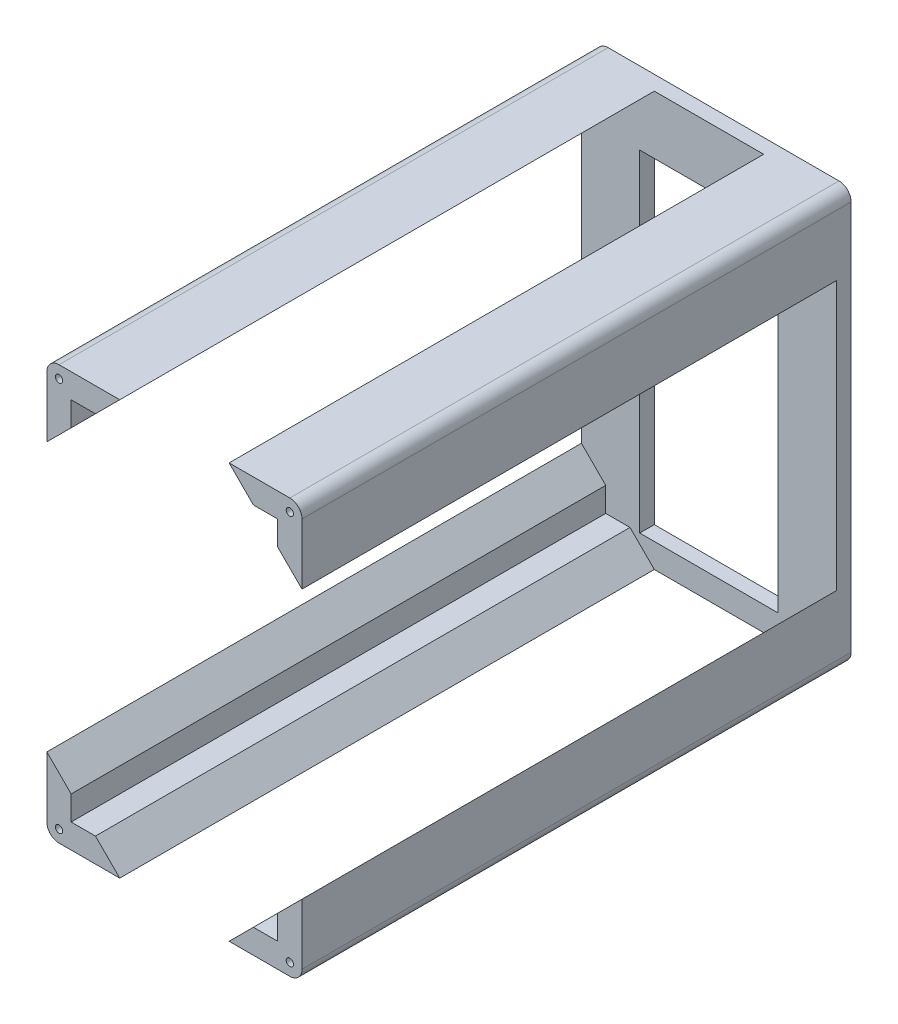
ISO-10303-21;
HEADER;
FILE_DESCRIPTION(('STEP AP214'),'2;1');
FILE_NAME('part.step','',(''),(''),'','','');
FILE_SCHEMA(('AUTOMOTIVE_DESIGN { 1 0 10303 214 1 1 1 1 }'));
ENDSEC;
DATA;
#1=APPLICATION_CONTEXT('core data for automotive mechanical design processes');
#2=APPLICATION_PROTOCOL_DEFINITION('international standard','automotive_design',2000,#1);
#3=PRODUCT_CONTEXT('',#1,'mechanical');
#4=PRODUCT('Part','Part','',(#3));
#5=PRODUCT_RELATED_PRODUCT_CATEGORY('part','',(#4));
#6=PRODUCT_DEFINITION_FORMATION('','',#4);
#7=PRODUCT_DEFINITION_CONTEXT('part definition',#1,'design');
#8=PRODUCT_DEFINITION('design','',#6,#7);
#9=PRODUCT_DEFINITION_SHAPE('','',#8);
#10=(LENGTH_UNIT() NAMED_UNIT(*) SI_UNIT(.MILLI.,.METRE.));
#11=(NAMED_UNIT(*) PLANE_ANGLE_UNIT() SI_UNIT($,.RADIAN.));
#12=(NAMED_UNIT(*) SI_UNIT($,.STERADIAN.) SOLID_ANGLE_UNIT());
#13=UNCERTAINTY_MEASURE_WITH_UNIT(LENGTH_MEASURE(1.E-05),#10,'distance_accuracy_value','');
#14=(GEOMETRIC_REPRESENTATION_CONTEXT(3) GLOBAL_UNCERTAINTY_ASSIGNED_CONTEXT((#13)) GLOBAL_UNIT_ASSIGNED_CONTEXT((#10,
#11,#12)) REPRESENTATION_CONTEXT('',''));
#15=CARTESIAN_POINT('',(0.,0.,0.));
#16=DIRECTION('',(0.,0.,1.));
#17=DIRECTION('',(1.,0.,0.));
#18=AXIS2_PLACEMENT_3D('',#15,#16,#17);
#19=CARTESIAN_POINT('',(0.,0.,226.));
#20=DIRECTION('',(0.,0.,-1.));
#21=DIRECTION('',(-1.,0.,0.));
#22=AXIS2_PLACEMENT_3D('',#19,#20,#21);
#23=PLANE('',#22);
#24=DIRECTION('',(0.,1.,0.));
#25=VECTOR('',#24,1.);
#26=CARTESIAN_POINT('',(-410.328787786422,71.,226.));
#27=LINE('',#26,#25);
#28=CARTESIAN_POINT('',(-410.328787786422,41.,226.));
#29=VERTEX_POINT('',#28);
#30=CARTESIAN_POINT('',(-410.328787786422,66.,226.));
#31=VERTEX_POINT('',#30);
#32=EDGE_CURVE('E351',#29,#31,#27,.T.);
#33=ORIENTED_EDGE('',*,*,#32,.T.);
#34=CARTESIAN_POINT('',(-415.328787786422,66.,226.));
#35=DIRECTION('',(0.,0.,-1.));
#36=DIRECTION('',(-1.,0.,0.));
#37=AXIS2_PLACEMENT_3D('',#34,#35,#36);
#38=CIRCLE('',#37,5.);
#39=CARTESIAN_POINT('',(-415.328787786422,71.,226.));
#40=VERTEX_POINT('',#39);
#41=EDGE_CURVE('E11',#31,#40,#38,.F.);
#42=ORIENTED_EDGE('',*,*,#41,.T.);
#43=DIRECTION('',(-1.,0.,0.));
#44=VECTOR('',#43,1.);
#45=CARTESIAN_POINT('',(-440.328787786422,71.,226.));
#46=LINE('',#45,#44);
#47=CARTESIAN_POINT('',(-440.328787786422,71.,226.));
#48=VERTEX_POINT('',#47);
#49=EDGE_CURVE('E366',#40,#48,#46,.T.);
#50=ORIENTED_EDGE('',*,*,#49,.T.);
#51=DIRECTION('',(0.707106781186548,-0.707106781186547,0.));
#52=VECTOR('',#51,1.);
#53=CARTESIAN_POINT('',(-410.328787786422,41.,226.));
#54=LINE('',#53,#52);
#55=CARTESIAN_POINT('',(-430.328787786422,61.,226.));
#56=VERTEX_POINT('',#55);
#57=EDGE_CURVE('E361',#48,#56,#54,.T.);
#58=ORIENTED_EDGE('',*,*,#57,.T.);
#59=DIRECTION('',(1.,0.,0.));
#60=VECTOR('',#59,1.);
#61=CARTESIAN_POINT('',(-505.328787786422,61.,226.));
#62=LINE('',#61,#60);
#63=CARTESIAN_POINT('',(-420.328787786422,61.,226.));
#64=VERTEX_POINT('',#63);
#65=EDGE_CURVE('E418',#56,#64,#62,.T.);
#66=ORIENTED_EDGE('',*,*,#65,.T.);
#67=DIRECTION('',(0.,1.,0.));
#68=VECTOR('',#67,1.);
#69=CARTESIAN_POINT('',(-420.328787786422,-89.5,226.));
#70=LINE('',#69,#68);
#71=CARTESIAN_POINT('',(-420.328787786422,51.,226.));
#72=VERTEX_POINT('',#71);
#73=EDGE_CURVE('E429',#72,#64,#70,.T.);
#74=ORIENTED_EDGE('',*,*,#73,.F.);
#75=EDGE_CURVE('E365',#72,#29,#54,.T.);
#76=ORIENTED_EDGE('',*,*,#75,.T.);
#77=EDGE_LOOP('',(#33,#42,#50,#58,#66,#74,#76));
#78=FACE_BOUND('',#77,.T.);
#79=CARTESIAN_POINT('',(-415.328787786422,66.,226.));
#80=DIRECTION('',(0.,0.,1.));
#81=DIRECTION('',(1.,0.,0.));
#82=AXIS2_PLACEMENT_3D('',#79,#80,#81);
#83=CIRCLE('',#82,1.5);
#84=CARTESIAN_POINT('',(-413.828787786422,66.,226.));
#85=VERTEX_POINT('',#84);
#86=EDGE_CURVE('E623',#85,#85,#83,.T.);
#87=ORIENTED_EDGE('',*,*,#86,.F.);
#88=EDGE_LOOP('',(#87));
#89=FACE_BOUND('',#88,.T.);
#90=ADVANCED_FACE('F36',(#78,#89),#23,.F.);
#91=CARTESIAN_POINT('',(-485.328787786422,71.,226.));
#92=DIRECTION('',(-0.707106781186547,0.707106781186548,0.));
#93=DIRECTION('',(-0.707106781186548,-0.707106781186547,0.));
#94=AXIS2_PLACEMENT_3D('',#91,#92,#93);
#95=PLANE('',#94);
#96=DIRECTION('',(0.,0.,1.));
#97=VECTOR('',#96,1.);
#98=CARTESIAN_POINT('',(-495.328787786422,61.,226.));
#99=LINE('',#98,#97);
#100=CARTESIAN_POINT('',(-495.328787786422,61.,6.00000000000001));
#101=VERTEX_POINT('',#100);
#102=CARTESIAN_POINT('',(-495.328787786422,61.,226.));
#103=VERTEX_POINT('',#102);
#104=EDGE_CURVE('E283',#101,#103,#99,.T.);
#105=ORIENTED_EDGE('',*,*,#104,.F.);
#106=DIRECTION('',(0.707106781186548,0.707106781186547,0.));
#107=VECTOR('',#106,1.);
#108=CARTESIAN_POINT('',(-485.328787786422,71.,6.));
#109=LINE('',#108,#107);
#110=CARTESIAN_POINT('',(-485.328787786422,71.,6.));
#111=VERTEX_POINT('',#110);
#112=EDGE_CURVE('E360',#101,#111,#109,.T.);
#113=ORIENTED_EDGE('',*,*,#112,.T.);
#114=DIRECTION('',(0.,0.,-1.));
#115=VECTOR('',#114,1.);
#116=CARTESIAN_POINT('',(-485.328787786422,71.,226.));
#117=LINE('',#116,#115);
#118=CARTESIAN_POINT('',(-485.328787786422,71.,226.));
#119=VERTEX_POINT('',#118);
#120=EDGE_CURVE('E393',#119,#111,#117,.T.);
#121=ORIENTED_EDGE('',*,*,#120,.F.);
#122=DIRECTION('',(0.707106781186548,0.707106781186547,0.));
#123=VECTOR('',#122,1.);
#124=CARTESIAN_POINT('',(-485.328787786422,71.,226.));
#125=LINE('',#124,#123);
#126=EDGE_CURVE('E390',#103,#119,#125,.T.);
#127=ORIENTED_EDGE('',*,*,#126,.F.);
#128=EDGE_LOOP('',(#105,#113,#121,#127));
#129=FACE_BOUND('',#128,.T.);
#130=ADVANCED_FACE('F526',(#129),#95,.F.);
#131=DIRECTION('',(0.,0.,-1.));
#132=VECTOR('',#131,1.);
#133=CARTESIAN_POINT('',(-505.328787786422,51.,226.));
#134=LINE('',#133,#132);
#135=CARTESIAN_POINT('',(-505.328787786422,51.,226.));
#136=VERTEX_POINT('',#135);
#137=CARTESIAN_POINT('',(-505.328787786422,51.,6.00000000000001));
#138=VERTEX_POINT('',#137);
#139=EDGE_CURVE('E295',#136,#138,#134,.T.);
#140=ORIENTED_EDGE('',*,*,#139,.F.);
#141=CARTESIAN_POINT('',(-515.328787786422,41.,226.));
#142=VERTEX_POINT('',#141);
#143=EDGE_CURVE('E388',#142,#136,#125,.T.);
#144=ORIENTED_EDGE('',*,*,#143,.F.);
#145=DIRECTION('',(0.,0.,-1.));
#146=VECTOR('',#145,1.);
#147=CARTESIAN_POINT('',(-515.328787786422,41.,226.));
#148=LINE('',#147,#146);
#149=CARTESIAN_POINT('',(-515.328787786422,41.,6.));
#150=VERTEX_POINT('',#149);
#151=EDGE_CURVE('E396',#142,#150,#148,.T.);
#152=ORIENTED_EDGE('',*,*,#151,.T.);
#153=EDGE_CURVE('E387',#150,#138,#109,.T.);
#154=ORIENTED_EDGE('',*,*,#153,.T.);
#155=EDGE_LOOP('',(#140,#144,#152,#154));
#156=FACE_BOUND('',#155,.T.);
#157=ADVANCED_FACE('F484',(#156),#95,.F.);
#158=CARTESIAN_POINT('',(-440.328787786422,-99.5,226.));
#159=DIRECTION('',(0.707106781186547,-0.707106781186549,0.));
#160=DIRECTION('',(0.707106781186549,0.707106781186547,0.));
#161=AXIS2_PLACEMENT_3D('',#158,#159,#160);
#162=PLANE('',#161);
#163=DIRECTION('',(-0.707106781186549,-0.707106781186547,0.));
#164=VECTOR('',#163,1.);
#165=CARTESIAN_POINT('',(-440.328787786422,-99.5,226.));
#166=LINE('',#165,#164);
#167=CARTESIAN_POINT('',(-430.328787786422,-89.5,226.));
#168=VERTEX_POINT('',#167);
#169=CARTESIAN_POINT('',(-440.328787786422,-99.5,226.));
#170=VERTEX_POINT('',#169);
#171=EDGE_CURVE('E337',#168,#170,#166,.T.);
#172=ORIENTED_EDGE('',*,*,#171,.F.);
#173=DIRECTION('',(0.,0.,-1.));
#174=VECTOR('',#173,1.);
#175=CARTESIAN_POINT('',(-430.328787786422,-89.5,226.));
#176=LINE('',#175,#174);
#177=CARTESIAN_POINT('',(-430.328787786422,-89.5,6.00000000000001));
#178=VERTEX_POINT('',#177);
#179=EDGE_CURVE('E299',#168,#178,#176,.T.);
#180=ORIENTED_EDGE('',*,*,#179,.T.);
#181=DIRECTION('',(-0.707106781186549,-0.707106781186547,0.));
#182=VECTOR('',#181,1.);
#183=CARTESIAN_POINT('',(-440.328787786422,-99.5,6.));
#184=LINE('',#183,#182);
#185=CARTESIAN_POINT('',(-440.328787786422,-99.5,6.));
#186=VERTEX_POINT('',#185);
#187=EDGE_CURVE('E251',#178,#186,#184,.T.);
#188=ORIENTED_EDGE('',*,*,#187,.T.);
#189=DIRECTION('',(0.,0.,-1.));
#190=VECTOR('',#189,1.);
#191=CARTESIAN_POINT('',(-440.328787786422,-99.5,226.));
#192=LINE('',#191,#190);
#193=EDGE_CURVE('E332',#170,#186,#192,.T.);
#194=ORIENTED_EDGE('',*,*,#193,.F.);
#195=EDGE_LOOP('',(#172,#180,#188,#194));
#196=FACE_BOUND('',#195,.T.);
#197=ADVANCED_FACE('F687',(#196),#162,.F.);
#198=CARTESIAN_POINT('',(-515.328787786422,-69.5,226.));
#199=DIRECTION('',(-0.707106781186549,-0.707106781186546,0.));
#200=DIRECTION('',(0.707106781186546,-0.707106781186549,0.));
#201=AXIS2_PLACEMENT_3D('',#198,#199,#200);
#202=PLANE('',#201);
#203=DIRECTION('',(0.,0.,1.));
#204=VECTOR('',#203,1.);
#205=CARTESIAN_POINT('',(-505.328787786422,-79.4999999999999,226.));
#206=LINE('',#205,#204);
#207=CARTESIAN_POINT('',(-505.328787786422,-79.4999999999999,6.));
#208=VERTEX_POINT('',#207);
#209=CARTESIAN_POINT('',(-505.328787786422,-79.4999999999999,226.));
#210=VERTEX_POINT('',#209);
#211=EDGE_CURVE('E292',#208,#210,#206,.T.);
#212=ORIENTED_EDGE('',*,*,#211,.F.);
#213=DIRECTION('',(-0.707106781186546,0.707106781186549,0.));
#214=VECTOR('',#213,1.);
#215=CARTESIAN_POINT('',(-515.328787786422,-69.5,6.));
#216=LINE('',#215,#214);
#217=CARTESIAN_POINT('',(-515.328787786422,-69.5,6.));
#218=VERTEX_POINT('',#217);
#219=EDGE_CURVE('E376',#208,#218,#216,.T.);
#220=ORIENTED_EDGE('',*,*,#219,.T.);
#221=DIRECTION('',(0.,0.,-1.));
#222=VECTOR('',#221,1.);
#223=CARTESIAN_POINT('',(-515.328787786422,-69.5,226.));
#224=LINE('',#223,#222);
#225=CARTESIAN_POINT('',(-515.328787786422,-69.5,226.));
#226=VERTEX_POINT('',#225);
#227=EDGE_CURVE('E369',#226,#218,#224,.T.);
#228=ORIENTED_EDGE('',*,*,#227,.F.);
#229=DIRECTION('',(-0.707106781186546,0.707106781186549,0.));
#230=VECTOR('',#229,1.);
#231=CARTESIAN_POINT('',(-515.328787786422,-69.5,226.));
#232=LINE('',#231,#230);
#233=EDGE_CURVE('E373',#210,#226,#232,.T.);
#234=ORIENTED_EDGE('',*,*,#233,.F.);
#235=EDGE_LOOP('',(#212,#220,#228,#234));
#236=FACE_BOUND('',#235,.T.);
#237=ADVANCED_FACE('F566',(#236),#202,.F.);
#238=CARTESIAN_POINT('',(0.,0.,226.));
#239=DIRECTION('',(0.,0.,1.));
#240=DIRECTION('',(1.,0.,0.));
#241=AXIS2_PLACEMENT_3D('',#238,#239,#240);
#242=PLANE('',#241);
#243=CARTESIAN_POINT('',(-510.328787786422,-94.5,226.));
#244=DIRECTION('',(0.,0.,1.));
#245=DIRECTION('',(1.,0.,0.));
#246=AXIS2_PLACEMENT_3D('',#243,#244,#245);
#247=CIRCLE('',#246,1.49999999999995);
#248=CARTESIAN_POINT('',(-508.828787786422,-94.5,226.));
#249=VERTEX_POINT('',#248);
#250=EDGE_CURVE('E496',#249,#249,#247,.T.);
#251=ORIENTED_EDGE('',*,*,#250,.F.);
#252=EDGE_LOOP('',(#251));
#253=FACE_BOUND('',#252,.T.);
#254=DIRECTION('',(0.,-1.,0.));
#255=VECTOR('',#254,1.);
#256=CARTESIAN_POINT('',(-515.328787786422,-99.5,226.));
#257=LINE('',#256,#255);
#258=CARTESIAN_POINT('',(-515.328787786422,-94.5,226.));
#259=VERTEX_POINT('',#258);
#260=EDGE_CURVE('E385',#226,#259,#257,.T.);
#261=ORIENTED_EDGE('',*,*,#260,.T.);
#262=CARTESIAN_POINT('',(-510.328787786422,-94.5,226.));
#263=DIRECTION('',(0.,0.,1.));
#264=DIRECTION('',(1.,0.,0.));
#265=AXIS2_PLACEMENT_3D('',#262,#263,#264);
#266=CIRCLE('',#265,5.);
#267=CARTESIAN_POINT('',(-510.328787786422,-99.5,226.));
#268=VERTEX_POINT('',#267);
#269=EDGE_CURVE('E445',#259,#268,#266,.T.);
#270=ORIENTED_EDGE('',*,*,#269,.T.);
#271=DIRECTION('',(1.,0.,0.));
#272=VECTOR('',#271,1.);
#273=CARTESIAN_POINT('',(-485.328787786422,-99.5,226.));
#274=LINE('',#273,#272);
#275=CARTESIAN_POINT('',(-485.328787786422,-99.5,226.));
#276=VERTEX_POINT('',#275);
#277=EDGE_CURVE('E379',#268,#276,#274,.T.);
#278=ORIENTED_EDGE('',*,*,#277,.T.);
#279=CARTESIAN_POINT('',(-495.328787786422,-89.5,226.));
#280=VERTEX_POINT('',#279);
#281=EDGE_CURVE('E380',#276,#280,#232,.T.);
#282=ORIENTED_EDGE('',*,*,#281,.T.);
#283=DIRECTION('',(1.,0.,0.));
#284=VECTOR('',#283,1.);
#285=CARTESIAN_POINT('',(-505.328787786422,-89.5,226.));
#286=LINE('',#285,#284);
#287=CARTESIAN_POINT('',(-505.328787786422,-89.5,226.));
#288=VERTEX_POINT('',#287);
#289=EDGE_CURVE('E609',#288,#280,#286,.T.);
#290=ORIENTED_EDGE('',*,*,#289,.F.);
#291=DIRECTION('',(0.,1.,0.));
#292=VECTOR('',#291,1.);
#293=CARTESIAN_POINT('',(-505.328787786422,-89.5,226.));
#294=LINE('',#293,#292);
#295=EDGE_CURVE('E288',#288,#210,#294,.T.);
#296=ORIENTED_EDGE('',*,*,#295,.T.);
#297=ORIENTED_EDGE('',*,*,#233,.T.);
#298=EDGE_LOOP('',(#261,#270,#278,#282,#290,#296,#297));
#299=FACE_BOUND('',#298,.T.);
#300=ADVANCED_FACE('F570',(#253,#299),#242,.T.);
#301=CARTESIAN_POINT('',(-410.328787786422,41.,226.));
#302=DIRECTION('',(0.707106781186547,0.707106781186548,0.));
#303=DIRECTION('',(-0.707106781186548,0.707106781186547,0.));
#304=AXIS2_PLACEMENT_3D('',#301,#302,#303);
#305=PLANE('',#304);
#306=DIRECTION('',(0.,0.,-1.));
#307=VECTOR('',#306,1.);
#308=CARTESIAN_POINT('',(-430.328787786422,61.,226.));
#309=LINE('',#308,#307);
#310=CARTESIAN_POINT('',(-430.328787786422,61.,6.00000000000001));
#311=VERTEX_POINT('',#310);
#312=EDGE_CURVE('E285',#56,#311,#309,.T.);
#313=ORIENTED_EDGE('',*,*,#312,.F.);
#314=ORIENTED_EDGE('',*,*,#57,.F.);
#315=DIRECTION('',(0.,0.,-1.));
#316=VECTOR('',#315,1.);
#317=CARTESIAN_POINT('',(-440.328787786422,71.,226.));
#318=LINE('',#317,#316);
#319=CARTESIAN_POINT('',(-440.328787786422,71.,6.));
#320=VERTEX_POINT('',#319);
#321=EDGE_CURVE('E350',#48,#320,#318,.T.);
#322=ORIENTED_EDGE('',*,*,#321,.T.);
#323=DIRECTION('',(0.707106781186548,-0.707106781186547,0.));
#324=VECTOR('',#323,1.);
#325=CARTESIAN_POINT('',(-410.328787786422,41.,6.));
#326=LINE('',#325,#324);
#327=EDGE_CURVE('E358',#320,#311,#326,.T.);
#328=ORIENTED_EDGE('',*,*,#327,.T.);
#329=EDGE_LOOP('',(#313,#314,#322,#328));
#330=FACE_BOUND('',#329,.T.);
#331=ADVANCED_FACE('F534',(#330),#305,.F.);
#332=CARTESIAN_POINT('',(0.,0.,6.));
#333=DIRECTION('',(0.,0.,-1.));
#334=DIRECTION('',(-1.,0.,0.));
#335=AXIS2_PLACEMENT_3D('',#332,#333,#334);
#336=PLANE('',#335);
#337=DIRECTION('',(1.,0.,0.));
#338=VECTOR('',#337,1.);
#339=CARTESIAN_POINT('',(-434.328787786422,-89.5,6.00000000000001));
#340=LINE('',#339,#338);
#341=CARTESIAN_POINT('',(-491.328787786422,-89.5,6.00000000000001));
#342=VERTEX_POINT('',#341);
#343=CARTESIAN_POINT('',(-434.328787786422,-89.5,6.00000000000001));
#344=VERTEX_POINT('',#343);
#345=EDGE_CURVE('E304',#342,#344,#340,.T.);
#346=ORIENTED_EDGE('',*,*,#345,.F.);
#347=DIRECTION('',(0.,-1.,0.));
#348=VECTOR('',#347,1.);
#349=CARTESIAN_POINT('',(-491.328787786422,-89.5,6.00000000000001));
#350=LINE('',#349,#348);
#351=CARTESIAN_POINT('',(-491.328787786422,47.,6.00000000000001));
#352=VERTEX_POINT('',#351);
#353=EDGE_CURVE('E308',#352,#342,#350,.T.);
#354=ORIENTED_EDGE('',*,*,#353,.F.);
#355=DIRECTION('',(-1.,0.,0.));
#356=VECTOR('',#355,1.);
#357=CARTESIAN_POINT('',(-434.328787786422,47.,6.00000000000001));
#358=LINE('',#357,#356);
#359=CARTESIAN_POINT('',(-434.328787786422,47.,6.));
#360=VERTEX_POINT('',#359);
#361=EDGE_CURVE('E309',#360,#352,#358,.T.);
#362=ORIENTED_EDGE('',*,*,#361,.F.);
#363=DIRECTION('',(0.,1.,0.));
#364=VECTOR('',#363,1.);
#365=CARTESIAN_POINT('',(-434.328787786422,-89.5,6.00000000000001));
#366=LINE('',#365,#364);
#367=EDGE_CURVE('E305',#344,#360,#366,.T.);
#368=ORIENTED_EDGE('',*,*,#367,.F.);
#369=EDGE_LOOP('',(#346,#354,#362,#368));
#370=FACE_BOUND('',#369,.T.);
#371=ORIENTED_EDGE('',*,*,#112,.F.);
#372=DIRECTION('',(1.,0.,0.));
#373=VECTOR('',#372,1.);
#374=CARTESIAN_POINT('',(-505.328787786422,61.,6.00000000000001));
#375=LINE('',#374,#373);
#376=CARTESIAN_POINT('',(-505.328787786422,61.,6.00000000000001));
#377=VERTEX_POINT('',#376);
#378=EDGE_CURVE('E489',#377,#101,#375,.T.);
#379=ORIENTED_EDGE('',*,*,#378,.F.);
#380=DIRECTION('',(0.,1.,0.));
#381=VECTOR('',#380,1.);
#382=CARTESIAN_POINT('',(-505.328787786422,-89.5,6.00000000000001));
#383=LINE('',#382,#381);
#384=EDGE_CURVE('E488',#138,#377,#383,.T.);
#385=ORIENTED_EDGE('',*,*,#384,.F.);
#386=ORIENTED_EDGE('',*,*,#153,.F.);
#387=DIRECTION('',(0.,1.,0.));
#388=VECTOR('',#387,1.);
#389=CARTESIAN_POINT('',(-515.328787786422,-99.5,6.));
#390=LINE('',#389,#388);
#391=EDGE_CURVE('E404',#218,#150,#390,.T.);
#392=ORIENTED_EDGE('',*,*,#391,.F.);
#393=ORIENTED_EDGE('',*,*,#219,.F.);
#394=CARTESIAN_POINT('',(-505.328787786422,-89.5,6.00000000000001));
#395=VERTEX_POINT('',#394);
#396=EDGE_CURVE('E493',#395,#208,#383,.T.);
#397=ORIENTED_EDGE('',*,*,#396,.F.);
#398=DIRECTION('',(1.,0.,0.));
#399=VECTOR('',#398,1.);
#400=CARTESIAN_POINT('',(-505.328787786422,-89.5,6.00000000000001));
#401=LINE('',#400,#399);
#402=CARTESIAN_POINT('',(-495.328787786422,-89.5,6.00000000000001));
#403=VERTEX_POINT('',#402);
#404=EDGE_CURVE('E257',#395,#403,#401,.T.);
#405=ORIENTED_EDGE('',*,*,#404,.T.);
#406=CARTESIAN_POINT('',(-485.328787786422,-99.5,6.));
#407=VERTEX_POINT('',#406);
#408=EDGE_CURVE('E354',#407,#403,#216,.T.);
#409=ORIENTED_EDGE('',*,*,#408,.F.);
#410=DIRECTION('',(1.,0.,0.));
#411=VECTOR('',#410,1.);
#412=CARTESIAN_POINT('',(-515.328787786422,-99.5,6.));
#413=LINE('',#412,#411);
#414=EDGE_CURVE('E411',#407,#186,#413,.T.);
#415=ORIENTED_EDGE('',*,*,#414,.T.);
#416=ORIENTED_EDGE('',*,*,#187,.F.);
#417=CARTESIAN_POINT('',(-420.328787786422,-89.5,6.00000000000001));
#418=VERTEX_POINT('',#417);
#419=EDGE_CURVE('E250',#178,#418,#401,.T.);
#420=ORIENTED_EDGE('',*,*,#419,.T.);
#421=DIRECTION('',(0.,1.,0.));
#422=VECTOR('',#421,1.);
#423=CARTESIAN_POINT('',(-420.328787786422,-89.5,6.00000000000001));
#424=LINE('',#423,#422);
#425=CARTESIAN_POINT('',(-420.328787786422,-79.5,6.00000000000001));
#426=VERTEX_POINT('',#425);
#427=EDGE_CURVE('E252',#418,#426,#424,.T.);
#428=ORIENTED_EDGE('',*,*,#427,.T.);
#429=CARTESIAN_POINT('',(-410.328787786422,-69.5000000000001,6.));
#430=VERTEX_POINT('',#429);
#431=EDGE_CURVE('E340',#430,#426,#184,.T.);
#432=ORIENTED_EDGE('',*,*,#431,.F.);
#433=DIRECTION('',(0.,1.,0.));
#434=VECTOR('',#433,1.);
#435=CARTESIAN_POINT('',(-410.328787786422,-99.5,6.));
#436=LINE('',#435,#434);
#437=CARTESIAN_POINT('',(-410.328787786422,41.,6.));
#438=VERTEX_POINT('',#437);
#439=EDGE_CURVE('E412',#430,#438,#436,.T.);
#440=ORIENTED_EDGE('',*,*,#439,.T.);
#441=CARTESIAN_POINT('',(-420.328787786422,51.,6.00000000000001));
#442=VERTEX_POINT('',#441);
#443=EDGE_CURVE('E359',#442,#438,#326,.T.);
#444=ORIENTED_EDGE('',*,*,#443,.F.);
#445=CARTESIAN_POINT('',(-420.328787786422,61.,6.00000000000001));
#446=VERTEX_POINT('',#445);
#447=EDGE_CURVE('E270',#442,#446,#424,.T.);
#448=ORIENTED_EDGE('',*,*,#447,.T.);
#449=EDGE_CURVE('E494',#311,#446,#375,.T.);
#450=ORIENTED_EDGE('',*,*,#449,.F.);
#451=ORIENTED_EDGE('',*,*,#327,.F.);
#452=DIRECTION('',(1.,0.,0.));
#453=VECTOR('',#452,1.);
#454=CARTESIAN_POINT('',(-515.328787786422,71.,6.));
#455=LINE('',#454,#453);
#456=EDGE_CURVE('E410',#111,#320,#455,.T.);
#457=ORIENTED_EDGE('',*,*,#456,.F.);
#458=EDGE_LOOP('',(#371,#379,#385,#386,#392,#393,#397,#405,#409,#415,#416,#420,#428,#432,#440,
#444,#448,#450,#451,#457));
#459=FACE_BOUND('',#458,.T.);
#460=ADVANCED_FACE('F249',(#370,#459),#336,.F.);
#461=CARTESIAN_POINT('',(-515.328787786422,-99.5,6.));
#462=DIRECTION('',(-1.,0.,0.));
#463=DIRECTION('',(0.,0.,1.));
#464=AXIS2_PLACEMENT_3D('',#461,#462,#463);
#465=PLANE('',#464);
#466=DIRECTION('',(0.,-1.,0.));
#467=VECTOR('',#466,1.);
#468=CARTESIAN_POINT('',(-515.328787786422,41.,226.));
#469=LINE('',#468,#467);
#470=CARTESIAN_POINT('',(-515.328787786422,66.,226.));
#471=VERTEX_POINT('',#470);
#472=EDGE_CURVE('E383',#471,#142,#469,.T.);
#473=ORIENTED_EDGE('',*,*,#472,.F.);
#474=DIRECTION('',(0.,0.,-1.));
#475=VECTOR('',#474,1.);
#476=CARTESIAN_POINT('',(-515.328787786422,66.,6.));
#477=LINE('',#476,#475);
#478=CARTESIAN_POINT('',(-515.328787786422,65.9999999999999,0.));
#479=VERTEX_POINT('',#478);
#480=EDGE_CURVE('E443',#471,#479,#477,.T.);
#481=ORIENTED_EDGE('',*,*,#480,.T.);
#482=DIRECTION('',(0.,1.,0.));
#483=VECTOR('',#482,1.);
#484=CARTESIAN_POINT('',(-515.328787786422,-99.5,0.));
#485=LINE('',#484,#483);
#486=CARTESIAN_POINT('',(-515.328787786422,-94.5,0.));
#487=VERTEX_POINT('',#486);
#488=EDGE_CURVE('E401',#487,#479,#485,.T.);
#489=ORIENTED_EDGE('',*,*,#488,.F.);
#490=DIRECTION('',(0.,0.,-1.));
#491=VECTOR('',#490,1.);
#492=CARTESIAN_POINT('',(-515.328787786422,-94.5,226.));
#493=LINE('',#492,#491);
#494=EDGE_CURVE('E439',#487,#259,#493,.F.);
#495=ORIENTED_EDGE('',*,*,#494,.T.);
#496=ORIENTED_EDGE('',*,*,#260,.F.);
#497=ORIENTED_EDGE('',*,*,#227,.T.);
#498=ORIENTED_EDGE('',*,*,#391,.T.);
#499=ORIENTED_EDGE('',*,*,#151,.F.);
#500=EDGE_LOOP('',(#473,#481,#489,#495,#496,#497,#498,#499));
#501=FACE_BOUND('',#500,.T.);
#502=ADVANCED_FACE('F472',(#501),#465,.T.);
#503=CARTESIAN_POINT('',(-515.328787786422,-99.5,6.));
#504=DIRECTION('',(0.,1.,0.));
#505=DIRECTION('',(0.,0.,1.));
#506=AXIS2_PLACEMENT_3D('',#503,#504,#505);
#507=PLANE('',#506);
#508=DIRECTION('',(1.,0.,0.));
#509=VECTOR('',#508,1.);
#510=CARTESIAN_POINT('',(-515.328787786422,-99.5,0.));
#511=LINE('',#510,#509);
#512=CARTESIAN_POINT('',(-510.328787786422,-99.5,0.));
#513=VERTEX_POINT('',#512);
#514=CARTESIAN_POINT('',(-415.328787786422,-99.5,0.));
#515=VERTEX_POINT('',#514);
#516=EDGE_CURVE('E407',#513,#515,#511,.T.);
#517=ORIENTED_EDGE('',*,*,#516,.T.);
#518=DIRECTION('',(0.,0.,-1.));
#519=VECTOR('',#518,1.);
#520=CARTESIAN_POINT('',(-415.328787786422,-99.5,6.));
#521=LINE('',#520,#519);
#522=CARTESIAN_POINT('',(-415.328787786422,-99.5,226.));
#523=VERTEX_POINT('',#522);
#524=EDGE_CURVE('E436',#515,#523,#521,.F.);
#525=ORIENTED_EDGE('',*,*,#524,.T.);
#526=DIRECTION('',(1.,0.,0.));
#527=VECTOR('',#526,1.);
#528=CARTESIAN_POINT('',(-410.328787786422,-99.5,226.));
#529=LINE('',#528,#527);
#530=EDGE_CURVE('E344',#170,#523,#529,.T.);
#531=ORIENTED_EDGE('',*,*,#530,.F.);
#532=ORIENTED_EDGE('',*,*,#193,.T.);
#533=ORIENTED_EDGE('',*,*,#414,.F.);
#534=DIRECTION('',(0.,0.,-1.));
#535=VECTOR('',#534,1.);
#536=CARTESIAN_POINT('',(-485.328787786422,-99.5,226.));
#537=LINE('',#536,#535);
#538=EDGE_CURVE('E339',#276,#407,#537,.T.);
#539=ORIENTED_EDGE('',*,*,#538,.F.);
#540=ORIENTED_EDGE('',*,*,#277,.F.);
#541=DIRECTION('',(0.,0.,-1.));
#542=VECTOR('',#541,1.);
#543=CARTESIAN_POINT('',(-510.328787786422,-99.5,0.));
#544=LINE('',#543,#542);
#545=EDGE_CURVE('E433',#268,#513,#544,.T.);
#546=ORIENTED_EDGE('',*,*,#545,.T.);
#547=EDGE_LOOP('',(#517,#525,#531,#532,#533,#539,#540,#546));
#548=FACE_BOUND('',#547,.T.);
#549=ADVANCED_FACE('F576',(#548),#507,.F.);
#550=CARTESIAN_POINT('',(-410.328787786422,-99.5,6.));
#551=DIRECTION('',(-1.,0.,0.));
#552=DIRECTION('',(0.,0.,1.));
#553=AXIS2_PLACEMENT_3D('',#550,#551,#552);
#554=PLANE('',#553);
#555=DIRECTION('',(0.,1.,0.));
#556=VECTOR('',#555,1.);
#557=CARTESIAN_POINT('',(-410.328787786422,-99.5,0.));
#558=LINE('',#557,#556);
#559=CARTESIAN_POINT('',(-410.328787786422,-94.5,0.));
#560=VERTEX_POINT('',#559);
#561=CARTESIAN_POINT('',(-410.328787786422,65.9999999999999,0.));
#562=VERTEX_POINT('',#561);
#563=EDGE_CURVE('E423',#560,#562,#558,.T.);
#564=ORIENTED_EDGE('',*,*,#563,.T.);
#565=DIRECTION('',(0.,0.,-1.));
#566=VECTOR('',#565,1.);
#567=CARTESIAN_POINT('',(-410.328787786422,66.,226.));
#568=LINE('',#567,#566);
#569=EDGE_CURVE('E46',#562,#31,#568,.F.);
#570=ORIENTED_EDGE('',*,*,#569,.T.);
#571=ORIENTED_EDGE('',*,*,#32,.F.);
#572=DIRECTION('',(0.,0.,-1.));
#573=VECTOR('',#572,1.);
#574=CARTESIAN_POINT('',(-410.328787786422,41.,226.));
#575=LINE('',#574,#573);
#576=EDGE_CURVE('E353',#29,#438,#575,.T.);
#577=ORIENTED_EDGE('',*,*,#576,.T.);
#578=ORIENTED_EDGE('',*,*,#439,.F.);
#579=DIRECTION('',(0.,0.,-1.));
#580=VECTOR('',#579,1.);
#581=CARTESIAN_POINT('',(-410.328787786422,-69.5,226.));
#582=LINE('',#581,#580);
#583=CARTESIAN_POINT('',(-410.328787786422,-69.5,226.));
#584=VERTEX_POINT('',#583);
#585=EDGE_CURVE('E328',#584,#430,#582,.T.);
#586=ORIENTED_EDGE('',*,*,#585,.F.);
#587=DIRECTION('',(0.,1.,0.));
#588=VECTOR('',#587,1.);
#589=CARTESIAN_POINT('',(-410.328787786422,-69.5,226.));
#590=LINE('',#589,#588);
#591=CARTESIAN_POINT('',(-410.328787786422,-94.5,226.));
#592=VERTEX_POINT('',#591);
#593=EDGE_CURVE('E342',#592,#584,#590,.T.);
#594=ORIENTED_EDGE('',*,*,#593,.F.);
#595=DIRECTION('',(0.,0.,-1.));
#596=VECTOR('',#595,1.);
#597=CARTESIAN_POINT('',(-410.328787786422,-94.5,6.));
#598=LINE('',#597,#596);
#599=EDGE_CURVE('E424',#592,#560,#598,.T.);
#600=ORIENTED_EDGE('',*,*,#599,.T.);
#601=EDGE_LOOP('',(#564,#570,#571,#577,#578,#586,#594,#600));
#602=FACE_BOUND('',#601,.T.);
#603=ADVANCED_FACE('F585',(#602),#554,.F.);
#604=CARTESIAN_POINT('',(-515.328787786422,71.,6.));
#605=DIRECTION('',(0.,1.,0.));
#606=DIRECTION('',(0.,0.,1.));
#607=AXIS2_PLACEMENT_3D('',#604,#605,#606);
#608=PLANE('',#607);
#609=ORIENTED_EDGE('',*,*,#49,.F.);
#610=DIRECTION('',(0.,0.,-1.));
#611=VECTOR('',#610,1.);
#612=CARTESIAN_POINT('',(-415.328787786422,71.,0.));
#613=LINE('',#612,#611);
#614=CARTESIAN_POINT('',(-415.328787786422,71.,0.));
#615=VERTEX_POINT('',#614);
#616=EDGE_CURVE('E452',#40,#615,#613,.T.);
#617=ORIENTED_EDGE('',*,*,#616,.T.);
#618=DIRECTION('',(1.,0.,0.));
#619=VECTOR('',#618,1.);
#620=CARTESIAN_POINT('',(-515.328787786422,71.,0.));
#621=LINE('',#620,#619);
#622=CARTESIAN_POINT('',(-510.328787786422,71.,0.));
#623=VERTEX_POINT('',#622);
#624=EDGE_CURVE('E420',#623,#615,#621,.T.);
#625=ORIENTED_EDGE('',*,*,#624,.F.);
#626=DIRECTION('',(0.,0.,-1.));
#627=VECTOR('',#626,1.);
#628=CARTESIAN_POINT('',(-510.328787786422,71.,6.));
#629=LINE('',#628,#627);
#630=CARTESIAN_POINT('',(-510.328787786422,71.,226.));
#631=VERTEX_POINT('',#630);
#632=EDGE_CURVE('E446',#623,#631,#629,.F.);
#633=ORIENTED_EDGE('',*,*,#632,.T.);
#634=DIRECTION('',(-1.,0.,0.));
#635=VECTOR('',#634,1.);
#636=CARTESIAN_POINT('',(-515.328787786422,71.,226.));
#637=LINE('',#636,#635);
#638=EDGE_CURVE('E394',#119,#631,#637,.T.);
#639=ORIENTED_EDGE('',*,*,#638,.F.);
#640=ORIENTED_EDGE('',*,*,#120,.T.);
#641=ORIENTED_EDGE('',*,*,#456,.T.);
#642=ORIENTED_EDGE('',*,*,#321,.F.);
#643=EDGE_LOOP('',(#609,#617,#625,#633,#639,#640,#641,#642));
#644=FACE_BOUND('',#643,.T.);
#645=ADVANCED_FACE('F458',(#644),#608,.T.);
#646=CARTESIAN_POINT('',(0.,0.,0.));
#647=DIRECTION('',(0.,0.,-1.));
#648=DIRECTION('',(-1.,0.,0.));
#649=AXIS2_PLACEMENT_3D('',#646,#647,#648);
#650=PLANE('',#649);
#651=DIRECTION('',(0.,1.,0.));
#652=VECTOR('',#651,1.);
#653=CARTESIAN_POINT('',(-491.328787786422,-89.5,0.));
#654=LINE('',#653,#652);
#655=CARTESIAN_POINT('',(-491.328787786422,-89.5,0.));
#656=VERTEX_POINT('',#655);
#657=CARTESIAN_POINT('',(-491.328787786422,47.,0.));
#658=VERTEX_POINT('',#657);
#659=EDGE_CURVE('E301',#656,#658,#654,.T.);
#660=ORIENTED_EDGE('',*,*,#659,.F.);
#661=DIRECTION('',(-1.,0.,0.));
#662=VECTOR('',#661,1.);
#663=CARTESIAN_POINT('',(-434.328787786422,-89.5,0.));
#664=LINE('',#663,#662);
#665=CARTESIAN_POINT('',(-434.328787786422,-89.5,0.));
#666=VERTEX_POINT('',#665);
#667=EDGE_CURVE('E319',#666,#656,#664,.T.);
#668=ORIENTED_EDGE('',*,*,#667,.F.);
#669=DIRECTION('',(0.,-1.,0.));
#670=VECTOR('',#669,1.);
#671=CARTESIAN_POINT('',(-434.328787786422,-89.5,0.));
#672=LINE('',#671,#670);
#673=CARTESIAN_POINT('',(-434.328787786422,47.,0.));
#674=VERTEX_POINT('',#673);
#675=EDGE_CURVE('E314',#674,#666,#672,.T.);
#676=ORIENTED_EDGE('',*,*,#675,.F.);
#677=DIRECTION('',(1.,0.,0.));
#678=VECTOR('',#677,1.);
#679=CARTESIAN_POINT('',(-434.328787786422,47.,0.));
#680=LINE('',#679,#678);
#681=EDGE_CURVE('E315',#658,#674,#680,.T.);
#682=ORIENTED_EDGE('',*,*,#681,.F.);
#683=EDGE_LOOP('',(#660,#668,#676,#682));
#684=FACE_BOUND('',#683,.T.);
#685=ORIENTED_EDGE('',*,*,#624,.T.);
#686=CARTESIAN_POINT('',(-415.328787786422,66.,0.));
#687=DIRECTION('',(0.,0.,-1.));
#688=DIRECTION('',(-1.,0.,0.));
#689=AXIS2_PLACEMENT_3D('',#686,#687,#688);
#690=CIRCLE('',#689,5.);
#691=EDGE_CURVE('E58',#615,#562,#690,.T.);
#692=ORIENTED_EDGE('',*,*,#691,.T.);
#693=ORIENTED_EDGE('',*,*,#563,.F.);
#694=CARTESIAN_POINT('',(-415.328787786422,-94.5,0.));
#695=DIRECTION('',(0.,0.,-1.));
#696=DIRECTION('',(-1.,0.,0.));
#697=AXIS2_PLACEMENT_3D('',#694,#695,#696);
#698=CIRCLE('',#697,5.);
#699=EDGE_CURVE('E431',#560,#515,#698,.T.);
#700=ORIENTED_EDGE('',*,*,#699,.T.);
#701=ORIENTED_EDGE('',*,*,#516,.F.);
#702=CARTESIAN_POINT('',(-510.328787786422,-94.5,0.));
#703=DIRECTION('',(0.,0.,-1.));
#704=DIRECTION('',(-1.,0.,0.));
#705=AXIS2_PLACEMENT_3D('',#702,#703,#704);
#706=CIRCLE('',#705,5.);
#707=EDGE_CURVE('E426',#513,#487,#706,.T.);
#708=ORIENTED_EDGE('',*,*,#707,.T.);
#709=ORIENTED_EDGE('',*,*,#488,.T.);
#710=CARTESIAN_POINT('',(-510.328787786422,66.,0.));
#711=DIRECTION('',(0.,0.,-1.));
#712=DIRECTION('',(-1.,0.,0.));
#713=AXIS2_PLACEMENT_3D('',#710,#711,#712);
#714=CIRCLE('',#713,5.);
#715=EDGE_CURVE('E450',#479,#623,#714,.T.);
#716=ORIENTED_EDGE('',*,*,#715,.T.);
#717=EDGE_LOOP('',(#685,#692,#693,#700,#701,#708,#709,#716));
#718=FACE_BOUND('',#717,.T.);
#719=ADVANCED_FACE('F461',(#684,#718),#650,.T.);
#720=CARTESIAN_POINT('',(0.,0.,226.));
#721=DIRECTION('',(0.,0.,-1.));
#722=DIRECTION('',(-1.,0.,0.));
#723=AXIS2_PLACEMENT_3D('',#720,#721,#722);
#724=PLANE('',#723);
#725=CARTESIAN_POINT('',(-510.328787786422,66.,226.));
#726=DIRECTION('',(0.,0.,1.));
#727=DIRECTION('',(1.,0.,0.));
#728=AXIS2_PLACEMENT_3D('',#725,#726,#727);
#729=CIRCLE('',#728,1.49999999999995);
#730=CARTESIAN_POINT('',(-508.828787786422,66.,226.));
#731=VERTEX_POINT('',#730);
#732=EDGE_CURVE('E630',#731,#731,#729,.T.);
#733=ORIENTED_EDGE('',*,*,#732,.F.);
#734=EDGE_LOOP('',(#733));
#735=FACE_BOUND('',#734,.T.);
#736=ORIENTED_EDGE('',*,*,#638,.T.);
#737=CARTESIAN_POINT('',(-510.328787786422,66.,226.));
#738=DIRECTION('',(0.,0.,-1.));
#739=DIRECTION('',(-1.,0.,0.));
#740=AXIS2_PLACEMENT_3D('',#737,#738,#739);
#741=CIRCLE('',#740,5.);
#742=EDGE_CURVE('E451',#631,#471,#741,.F.);
#743=ORIENTED_EDGE('',*,*,#742,.T.);
#744=ORIENTED_EDGE('',*,*,#472,.T.);
#745=ORIENTED_EDGE('',*,*,#143,.T.);
#746=CARTESIAN_POINT('',(-505.328787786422,61.,226.));
#747=VERTEX_POINT('',#746);
#748=EDGE_CURVE('E282',#136,#747,#294,.T.);
#749=ORIENTED_EDGE('',*,*,#748,.T.);
#750=EDGE_CURVE('E284',#747,#103,#62,.T.);
#751=ORIENTED_EDGE('',*,*,#750,.T.);
#752=ORIENTED_EDGE('',*,*,#126,.T.);
#753=EDGE_LOOP('',(#736,#743,#744,#745,#749,#751,#752));
#754=FACE_BOUND('',#753,.T.);
#755=ADVANCED_FACE('F480',(#735,#754),#724,.F.);
#756=ORIENTED_EDGE('',*,*,#431,.T.);
#757=DIRECTION('',(0.,0.,1.));
#758=VECTOR('',#757,1.);
#759=CARTESIAN_POINT('',(-420.328787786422,-79.5,226.));
#760=LINE('',#759,#758);
#761=CARTESIAN_POINT('',(-420.328787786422,-79.5,226.));
#762=VERTEX_POINT('',#761);
#763=EDGE_CURVE('E269',#426,#762,#760,.T.);
#764=ORIENTED_EDGE('',*,*,#763,.T.);
#765=EDGE_CURVE('E338',#584,#762,#166,.T.);
#766=ORIENTED_EDGE('',*,*,#765,.F.);
#767=ORIENTED_EDGE('',*,*,#585,.T.);
#768=EDGE_LOOP('',(#756,#764,#766,#767));
#769=FACE_BOUND('',#768,.T.);
#770=ADVANCED_FACE('F571',(#769),#162,.F.);
#771=CARTESIAN_POINT('',(0.,0.,226.));
#772=DIRECTION('',(0.,0.,1.));
#773=DIRECTION('',(1.,0.,0.));
#774=AXIS2_PLACEMENT_3D('',#771,#772,#773);
#775=PLANE('',#774);
#776=CARTESIAN_POINT('',(-415.328787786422,-94.5,226.));
#777=DIRECTION('',(0.,0.,1.));
#778=DIRECTION('',(1.,0.,0.));
#779=AXIS2_PLACEMENT_3D('',#776,#777,#778);
#780=CIRCLE('',#779,1.5);
#781=CARTESIAN_POINT('',(-413.828787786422,-94.5,226.));
#782=VERTEX_POINT('',#781);
#783=EDGE_CURVE('E611',#782,#782,#780,.T.);
#784=ORIENTED_EDGE('',*,*,#783,.F.);
#785=EDGE_LOOP('',(#784));
#786=FACE_BOUND('',#785,.T.);
#787=ORIENTED_EDGE('',*,*,#530,.T.);
#788=CARTESIAN_POINT('',(-415.328787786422,-94.5,226.));
#789=DIRECTION('',(0.,0.,1.));
#790=DIRECTION('',(1.,0.,0.));
#791=AXIS2_PLACEMENT_3D('',#788,#789,#790);
#792=CIRCLE('',#791,5.);
#793=EDGE_CURVE('E438',#523,#592,#792,.T.);
#794=ORIENTED_EDGE('',*,*,#793,.T.);
#795=ORIENTED_EDGE('',*,*,#593,.T.);
#796=ORIENTED_EDGE('',*,*,#765,.T.);
#797=CARTESIAN_POINT('',(-420.328787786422,-89.5,226.));
#798=VERTEX_POINT('',#797);
#799=EDGE_CURVE('E258',#798,#762,#70,.T.);
#800=ORIENTED_EDGE('',*,*,#799,.F.);
#801=EDGE_CURVE('E271',#168,#798,#286,.T.);
#802=ORIENTED_EDGE('',*,*,#801,.F.);
#803=ORIENTED_EDGE('',*,*,#171,.T.);
#804=EDGE_LOOP('',(#787,#794,#795,#796,#800,#802,#803));
#805=FACE_BOUND('',#804,.T.);
#806=ADVANCED_FACE('F562',(#786,#805),#775,.T.);
#807=ORIENTED_EDGE('',*,*,#408,.T.);
#808=DIRECTION('',(0.,0.,1.));
#809=VECTOR('',#808,1.);
#810=CARTESIAN_POINT('',(-495.328787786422,-89.5,226.));
#811=LINE('',#810,#809);
#812=EDGE_CURVE('E298',#403,#280,#811,.T.);
#813=ORIENTED_EDGE('',*,*,#812,.T.);
#814=ORIENTED_EDGE('',*,*,#281,.F.);
#815=ORIENTED_EDGE('',*,*,#538,.T.);
#816=EDGE_LOOP('',(#807,#813,#814,#815));
#817=FACE_BOUND('',#816,.T.);
#818=ADVANCED_FACE('F561',(#817),#202,.F.);
#819=ORIENTED_EDGE('',*,*,#75,.F.);
#820=DIRECTION('',(0.,0.,-1.));
#821=VECTOR('',#820,1.);
#822=CARTESIAN_POINT('',(-420.328787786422,51.,226.));
#823=LINE('',#822,#821);
#824=EDGE_CURVE('E287',#72,#442,#823,.T.);
#825=ORIENTED_EDGE('',*,*,#824,.T.);
#826=ORIENTED_EDGE('',*,*,#443,.T.);
#827=ORIENTED_EDGE('',*,*,#576,.F.);
#828=EDGE_LOOP('',(#819,#825,#826,#827));
#829=FACE_BOUND('',#828,.T.);
#830=ADVANCED_FACE('F537',(#829),#305,.F.);
#831=CARTESIAN_POINT('',(-491.328787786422,-89.5,153.92312192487));
#832=DIRECTION('',(-1.,0.,0.));
#833=DIRECTION('',(0.,0.,1.));
#834=AXIS2_PLACEMENT_3D('',#831,#832,#833);
#835=PLANE('',#834);
#836=ORIENTED_EDGE('',*,*,#353,.T.);
#837=DIRECTION('',(0.,0.,-1.));
#838=VECTOR('',#837,1.);
#839=CARTESIAN_POINT('',(-491.328787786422,-89.5,153.92312192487));
#840=LINE('',#839,#838);
#841=EDGE_CURVE('E306',#342,#656,#840,.T.);
#842=ORIENTED_EDGE('',*,*,#841,.T.);
#843=ORIENTED_EDGE('',*,*,#659,.T.);
#844=DIRECTION('',(0.,0.,-1.));
#845=VECTOR('',#844,1.);
#846=CARTESIAN_POINT('',(-491.328787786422,47.,153.92312192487));
#847=LINE('',#846,#845);
#848=EDGE_CURVE('E321',#352,#658,#847,.T.);
#849=ORIENTED_EDGE('',*,*,#848,.F.);
#850=EDGE_LOOP('',(#836,#842,#843,#849));
#851=FACE_BOUND('',#850,.T.);
#852=ADVANCED_FACE('F678',(#851),#835,.F.);
#853=CARTESIAN_POINT('',(-434.328787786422,-89.5,153.92312192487));
#854=DIRECTION('',(0.,-1.,0.));
#855=DIRECTION('',(0.,0.,-1.));
#856=AXIS2_PLACEMENT_3D('',#853,#854,#855);
#857=PLANE('',#856);
#858=ORIENTED_EDGE('',*,*,#345,.T.);
#859=DIRECTION('',(0.,0.,-1.));
#860=VECTOR('',#859,1.);
#861=CARTESIAN_POINT('',(-434.328787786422,-89.5,153.92312192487));
#862=LINE('',#861,#860);
#863=EDGE_CURVE('E322',#344,#666,#862,.T.);
#864=ORIENTED_EDGE('',*,*,#863,.T.);
#865=ORIENTED_EDGE('',*,*,#667,.T.);
#866=ORIENTED_EDGE('',*,*,#841,.F.);
#867=EDGE_LOOP('',(#858,#864,#865,#866));
#868=FACE_BOUND('',#867,.T.);
#869=ADVANCED_FACE('F674',(#868),#857,.F.);
#870=CARTESIAN_POINT('',(-434.328787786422,-89.5,153.92312192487));
#871=DIRECTION('',(1.,0.,0.));
#872=DIRECTION('',(0.,0.,-1.));
#873=AXIS2_PLACEMENT_3D('',#870,#871,#872);
#874=PLANE('',#873);
#875=ORIENTED_EDGE('',*,*,#367,.T.);
#876=DIRECTION('',(0.,0.,-1.));
#877=VECTOR('',#876,1.);
#878=CARTESIAN_POINT('',(-434.328787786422,47.,153.92312192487));
#879=LINE('',#878,#877);
#880=EDGE_CURVE('E324',#360,#674,#879,.T.);
#881=ORIENTED_EDGE('',*,*,#880,.T.);
#882=ORIENTED_EDGE('',*,*,#675,.T.);
#883=ORIENTED_EDGE('',*,*,#863,.F.);
#884=EDGE_LOOP('',(#875,#881,#882,#883));
#885=FACE_BOUND('',#884,.T.);
#886=ADVANCED_FACE('F673',(#885),#874,.F.);
#887=CARTESIAN_POINT('',(-434.328787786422,47.,153.92312192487));
#888=DIRECTION('',(0.,1.,0.));
#889=DIRECTION('',(0.,0.,1.));
#890=AXIS2_PLACEMENT_3D('',#887,#888,#889);
#891=PLANE('',#890);
#892=ORIENTED_EDGE('',*,*,#361,.T.);
#893=ORIENTED_EDGE('',*,*,#848,.T.);
#894=ORIENTED_EDGE('',*,*,#681,.T.);
#895=ORIENTED_EDGE('',*,*,#880,.F.);
#896=EDGE_LOOP('',(#892,#893,#894,#895));
#897=FACE_BOUND('',#896,.T.);
#898=ADVANCED_FACE('F676',(#897),#891,.F.);
#899=CARTESIAN_POINT('',(-505.328787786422,61.,-166.844583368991));
#900=DIRECTION('',(0.,-1.,0.));
#901=DIRECTION('',(0.,0.,-1.));
#902=AXIS2_PLACEMENT_3D('',#899,#900,#901);
#903=PLANE('',#902);
#904=ORIENTED_EDGE('',*,*,#312,.T.);
#905=ORIENTED_EDGE('',*,*,#449,.T.);
#906=DIRECTION('',(0.,0.,1.));
#907=VECTOR('',#906,1.);
#908=CARTESIAN_POINT('',(-420.328787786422,61.,-166.844583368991));
#909=LINE('',#908,#907);
#910=EDGE_CURVE('E267',#446,#64,#909,.T.);
#911=ORIENTED_EDGE('',*,*,#910,.T.);
#912=ORIENTED_EDGE('',*,*,#65,.F.);
#913=EDGE_LOOP('',(#904,#905,#911,#912));
#914=FACE_BOUND('',#913,.T.);
#915=ADVANCED_FACE('F508',(#914),#903,.T.);
#916=CARTESIAN_POINT('',(-420.328787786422,-89.5,-166.844583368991));
#917=DIRECTION('',(1.,0.,0.));
#918=DIRECTION('',(0.,0.,-1.));
#919=AXIS2_PLACEMENT_3D('',#916,#917,#918);
#920=PLANE('',#919);
#921=ORIENTED_EDGE('',*,*,#73,.T.);
#922=ORIENTED_EDGE('',*,*,#910,.F.);
#923=ORIENTED_EDGE('',*,*,#447,.F.);
#924=ORIENTED_EDGE('',*,*,#824,.F.);
#925=EDGE_LOOP('',(#921,#922,#923,#924));
#926=FACE_BOUND('',#925,.T.);
#927=ADVANCED_FACE('F536',(#926),#920,.F.);
#928=CARTESIAN_POINT('',(-505.328787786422,-89.5,-166.844583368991));
#929=DIRECTION('',(1.,0.,0.));
#930=DIRECTION('',(0.,0.,-1.));
#931=AXIS2_PLACEMENT_3D('',#928,#929,#930);
#932=PLANE('',#931);
#933=ORIENTED_EDGE('',*,*,#211,.T.);
#934=ORIENTED_EDGE('',*,*,#295,.F.);
#935=DIRECTION('',(0.,0.,1.));
#936=VECTOR('',#935,1.);
#937=CARTESIAN_POINT('',(-505.328787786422,-89.5,-166.844583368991));
#938=LINE('',#937,#936);
#939=EDGE_CURVE('E278',#395,#288,#938,.T.);
#940=ORIENTED_EDGE('',*,*,#939,.F.);
#941=ORIENTED_EDGE('',*,*,#396,.T.);
#942=EDGE_LOOP('',(#933,#934,#940,#941));
#943=FACE_BOUND('',#942,.T.);
#944=ADVANCED_FACE('F664',(#943),#932,.T.);
#945=CARTESIAN_POINT('',(-505.328787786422,-89.5,-166.844583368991));
#946=DIRECTION('',(0.,-1.,0.));
#947=DIRECTION('',(0.,0.,-1.));
#948=AXIS2_PLACEMENT_3D('',#945,#946,#947);
#949=PLANE('',#948);
#950=ORIENTED_EDGE('',*,*,#404,.F.);
#951=ORIENTED_EDGE('',*,*,#939,.T.);
#952=ORIENTED_EDGE('',*,*,#289,.T.);
#953=ORIENTED_EDGE('',*,*,#812,.F.);
#954=EDGE_LOOP('',(#950,#951,#952,#953));
#955=FACE_BOUND('',#954,.T.);
#956=ADVANCED_FACE('F668',(#955),#949,.F.);
#957=ORIENTED_EDGE('',*,*,#427,.F.);
#958=DIRECTION('',(0.,0.,1.));
#959=VECTOR('',#958,1.);
#960=CARTESIAN_POINT('',(-420.328787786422,-89.5,-166.844583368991));
#961=LINE('',#960,#959);
#962=EDGE_CURVE('E261',#418,#798,#961,.T.);
#963=ORIENTED_EDGE('',*,*,#962,.T.);
#964=ORIENTED_EDGE('',*,*,#799,.T.);
#965=ORIENTED_EDGE('',*,*,#763,.F.);
#966=EDGE_LOOP('',(#957,#963,#964,#965));
#967=FACE_BOUND('',#966,.T.);
#968=ADVANCED_FACE('F265',(#967),#920,.F.);
#969=ORIENTED_EDGE('',*,*,#801,.T.);
#970=ORIENTED_EDGE('',*,*,#962,.F.);
#971=ORIENTED_EDGE('',*,*,#419,.F.);
#972=ORIENTED_EDGE('',*,*,#179,.F.);
#973=EDGE_LOOP('',(#969,#970,#971,#972));
#974=FACE_BOUND('',#973,.T.);
#975=ADVANCED_FACE('F272',(#974),#949,.F.);
#976=ORIENTED_EDGE('',*,*,#139,.T.);
#977=ORIENTED_EDGE('',*,*,#384,.T.);
#978=DIRECTION('',(0.,0.,1.));
#979=VECTOR('',#978,1.);
#980=CARTESIAN_POINT('',(-505.328787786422,61.,-166.844583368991));
#981=LINE('',#980,#979);
#982=EDGE_CURVE('E499',#377,#747,#981,.T.);
#983=ORIENTED_EDGE('',*,*,#982,.T.);
#984=ORIENTED_EDGE('',*,*,#748,.F.);
#985=EDGE_LOOP('',(#976,#977,#983,#984));
#986=FACE_BOUND('',#985,.T.);
#987=ADVANCED_FACE('F481',(#986),#932,.T.);
#988=ORIENTED_EDGE('',*,*,#104,.T.);
#989=ORIENTED_EDGE('',*,*,#750,.F.);
#990=ORIENTED_EDGE('',*,*,#982,.F.);
#991=ORIENTED_EDGE('',*,*,#378,.T.);
#992=EDGE_LOOP('',(#988,#989,#990,#991));
#993=FACE_BOUND('',#992,.T.);
#994=ADVANCED_FACE('F592',(#993),#903,.T.);
#995=CARTESIAN_POINT('',(-415.328787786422,-94.5,6.));
#996=DIRECTION('',(0.,0.,-1.));
#997=DIRECTION('',(-1.,0.,0.));
#998=AXIS2_PLACEMENT_3D('',#995,#996,#997);
#999=CYLINDRICAL_SURFACE('',#998,5.);
#1000=ORIENTED_EDGE('',*,*,#793,.F.);
#1001=ORIENTED_EDGE('',*,*,#524,.F.);
#1002=ORIENTED_EDGE('',*,*,#699,.F.);
#1003=ORIENTED_EDGE('',*,*,#599,.F.);
#1004=EDGE_LOOP('',(#1000,#1001,#1002,#1003));
#1005=FACE_BOUND('',#1004,.T.);
#1006=ADVANCED_FACE('F588',(#1005),#999,.T.);
#1007=CARTESIAN_POINT('',(-510.328787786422,-94.5,6.));
#1008=DIRECTION('',(0.,0.,1.));
#1009=DIRECTION('',(1.,0.,0.));
#1010=AXIS2_PLACEMENT_3D('',#1007,#1008,#1009);
#1011=CYLINDRICAL_SURFACE('',#1010,5.);
#1012=ORIENTED_EDGE('',*,*,#269,.F.);
#1013=ORIENTED_EDGE('',*,*,#494,.F.);
#1014=ORIENTED_EDGE('',*,*,#707,.F.);
#1015=ORIENTED_EDGE('',*,*,#545,.F.);
#1016=EDGE_LOOP('',(#1012,#1013,#1014,#1015));
#1017=FACE_BOUND('',#1016,.T.);
#1018=ADVANCED_FACE('F553',(#1017),#1011,.T.);
#1019=CARTESIAN_POINT('',(-510.328787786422,66.,6.));
#1020=DIRECTION('',(0.,0.,-1.));
#1021=DIRECTION('',(-1.,0.,0.));
#1022=AXIS2_PLACEMENT_3D('',#1019,#1020,#1021);
#1023=CYLINDRICAL_SURFACE('',#1022,5.);
#1024=ORIENTED_EDGE('',*,*,#742,.F.);
#1025=ORIENTED_EDGE('',*,*,#632,.F.);
#1026=ORIENTED_EDGE('',*,*,#715,.F.);
#1027=ORIENTED_EDGE('',*,*,#480,.F.);
#1028=EDGE_LOOP('',(#1024,#1025,#1026,#1027));
#1029=FACE_BOUND('',#1028,.T.);
#1030=ADVANCED_FACE('F468',(#1029),#1023,.T.);
#1031=CARTESIAN_POINT('',(-415.328787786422,66.,6.));
#1032=DIRECTION('',(0.,0.,1.));
#1033=DIRECTION('',(1.,0.,0.));
#1034=AXIS2_PLACEMENT_3D('',#1031,#1032,#1033);
#1035=CYLINDRICAL_SURFACE('',#1034,5.);
#1036=ORIENTED_EDGE('',*,*,#41,.F.);
#1037=ORIENTED_EDGE('',*,*,#569,.F.);
#1038=ORIENTED_EDGE('',*,*,#691,.F.);
#1039=ORIENTED_EDGE('',*,*,#616,.F.);
#1040=EDGE_LOOP('',(#1036,#1037,#1038,#1039));
#1041=FACE_BOUND('',#1040,.T.);
#1042=ADVANCED_FACE('F37',(#1041),#1035,.T.);
#1043=CARTESIAN_POINT('',(-510.328787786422,-94.5,221.));
#1044=DIRECTION('',(0.,0.,-1.));
#1045=DIRECTION('',(-1.,0.,0.));
#1046=AXIS2_PLACEMENT_3D('',#1043,#1044,#1045);
#1047=PLANE('',#1046);
#1048=CARTESIAN_POINT('',(-510.328787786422,-94.5,221.));
#1049=DIRECTION('',(0.,0.,1.));
#1050=DIRECTION('',(1.,0.,0.));
#1051=AXIS2_PLACEMENT_3D('',#1048,#1049,#1050);
#1052=CIRCLE('',#1051,1.49999999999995);
#1053=CARTESIAN_POINT('',(-508.828787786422,-94.5,221.));
#1054=VERTEX_POINT('',#1053);
#1055=EDGE_CURVE('E495',#1054,#1054,#1052,.T.);
#1056=ORIENTED_EDGE('',*,*,#1055,.T.);
#1057=EDGE_LOOP('',(#1056));
#1058=FACE_BOUND('',#1057,.T.);
#1059=ADVANCED_FACE('F542',(#1058),#1047,.F.);
#1060=CARTESIAN_POINT('',(-510.328787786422,-94.5,226.));
#1061=DIRECTION('',(0.,0.,1.));
#1062=DIRECTION('',(1.,0.,0.));
#1063=AXIS2_PLACEMENT_3D('',#1060,#1061,#1062);
#1064=CYLINDRICAL_SURFACE('',#1063,1.49999999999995);
#1065=ORIENTED_EDGE('',*,*,#1055,.F.);
#1066=EDGE_LOOP('',(#1065));
#1067=FACE_BOUND('',#1066,.T.);
#1068=ORIENTED_EDGE('',*,*,#250,.T.);
#1069=EDGE_LOOP('',(#1068));
#1070=FACE_BOUND('',#1069,.T.);
#1071=ADVANCED_FACE('F549',(#1067,#1070),#1064,.F.);
#1072=CARTESIAN_POINT('',(-415.328787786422,-94.5,221.));
#1073=DIRECTION('',(0.,0.,-1.));
#1074=DIRECTION('',(-1.,0.,0.));
#1075=AXIS2_PLACEMENT_3D('',#1072,#1073,#1074);
#1076=PLANE('',#1075);
#1077=CARTESIAN_POINT('',(-415.328787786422,-94.5,221.));
#1078=DIRECTION('',(0.,0.,1.));
#1079=DIRECTION('',(1.,0.,0.));
#1080=AXIS2_PLACEMENT_3D('',#1077,#1078,#1079);
#1081=CIRCLE('',#1080,1.49999999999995);
#1082=CARTESIAN_POINT('',(-413.828787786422,-94.5,221.));
#1083=VERTEX_POINT('',#1082);
#1084=EDGE_CURVE('E614',#1083,#1083,#1081,.T.);
#1085=ORIENTED_EDGE('',*,*,#1084,.T.);
#1086=EDGE_LOOP('',(#1085));
#1087=FACE_BOUND('',#1086,.T.);
#1088=ADVANCED_FACE('F651',(#1087),#1076,.F.);
#1089=CARTESIAN_POINT('',(-415.328787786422,-94.5,226.));
#1090=DIRECTION('',(0.,0.,1.));
#1091=DIRECTION('',(1.,0.,0.));
#1092=AXIS2_PLACEMENT_3D('',#1089,#1090,#1091);
#1093=CYLINDRICAL_SURFACE('',#1092,1.49999999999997);
#1094=ORIENTED_EDGE('',*,*,#1084,.F.);
#1095=EDGE_LOOP('',(#1094));
#1096=FACE_BOUND('',#1095,.T.);
#1097=ORIENTED_EDGE('',*,*,#783,.T.);
#1098=EDGE_LOOP('',(#1097));
#1099=FACE_BOUND('',#1098,.T.);
#1100=ADVANCED_FACE('F649',(#1096,#1099),#1093,.F.);
#1101=CARTESIAN_POINT('',(-415.328787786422,66.,221.));
#1102=DIRECTION('',(0.,0.,-1.));
#1103=DIRECTION('',(-1.,0.,0.));
#1104=AXIS2_PLACEMENT_3D('',#1101,#1102,#1103);
#1105=PLANE('',#1104);
#1106=CARTESIAN_POINT('',(-415.328787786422,66.,221.));
#1107=DIRECTION('',(0.,0.,1.));
#1108=DIRECTION('',(1.,0.,0.));
#1109=AXIS2_PLACEMENT_3D('',#1106,#1107,#1108);
#1110=CIRCLE('',#1109,1.49999999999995);
#1111=CARTESIAN_POINT('',(-413.828787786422,66.,221.));
#1112=VERTEX_POINT('',#1111);
#1113=EDGE_CURVE('E616',#1112,#1112,#1110,.T.);
#1114=ORIENTED_EDGE('',*,*,#1113,.T.);
#1115=EDGE_LOOP('',(#1114));
#1116=FACE_BOUND('',#1115,.T.);
#1117=ADVANCED_FACE('F646',(#1116),#1105,.F.);
#1118=CARTESIAN_POINT('',(-415.328787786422,66.,226.));
#1119=DIRECTION('',(0.,0.,1.));
#1120=DIRECTION('',(1.,0.,0.));
#1121=AXIS2_PLACEMENT_3D('',#1118,#1119,#1120);
#1122=CYLINDRICAL_SURFACE('',#1121,1.49999999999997);
#1123=ORIENTED_EDGE('',*,*,#1113,.F.);
#1124=EDGE_LOOP('',(#1123));
#1125=FACE_BOUND('',#1124,.T.);
#1126=ORIENTED_EDGE('',*,*,#86,.T.);
#1127=EDGE_LOOP('',(#1126));
#1128=FACE_BOUND('',#1127,.T.);
#1129=ADVANCED_FACE('F638',(#1125,#1128),#1122,.F.);
#1130=CARTESIAN_POINT('',(-510.328787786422,66.,221.));
#1131=DIRECTION('',(0.,0.,-1.));
#1132=DIRECTION('',(-1.,0.,0.));
#1133=AXIS2_PLACEMENT_3D('',#1130,#1131,#1132);
#1134=PLANE('',#1133);
#1135=CARTESIAN_POINT('',(-510.328787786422,66.,221.));
#1136=DIRECTION('',(0.,0.,1.));
#1137=DIRECTION('',(1.,0.,0.));
#1138=AXIS2_PLACEMENT_3D('',#1135,#1136,#1137);
#1139=CIRCLE('',#1138,1.49999999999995);
#1140=CARTESIAN_POINT('',(-508.828787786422,66.,221.));
#1141=VERTEX_POINT('',#1140);
#1142=EDGE_CURVE('E624',#1141,#1141,#1139,.T.);
#1143=ORIENTED_EDGE('',*,*,#1142,.T.);
#1144=EDGE_LOOP('',(#1143));
#1145=FACE_BOUND('',#1144,.T.);
#1146=ADVANCED_FACE('F633',(#1145),#1134,.F.);
#1147=CARTESIAN_POINT('',(-510.328787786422,66.,226.));
#1148=DIRECTION('',(0.,0.,1.));
#1149=DIRECTION('',(1.,0.,0.));
#1150=AXIS2_PLACEMENT_3D('',#1147,#1148,#1149);
#1151=CYLINDRICAL_SURFACE('',#1150,1.49999999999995);
#1152=ORIENTED_EDGE('',*,*,#1142,.F.);
#1153=EDGE_LOOP('',(#1152));
#1154=FACE_BOUND('',#1153,.T.);
#1155=ORIENTED_EDGE('',*,*,#732,.T.);
#1156=EDGE_LOOP('',(#1155));
#1157=FACE_BOUND('',#1156,.T.);
#1158=ADVANCED_FACE('F631',(#1154,#1157),#1151,.F.);
#1159=CLOSED_SHELL('',(#90,#130,#157,#197,#237,#300,#331,#460,#502,#549,#603,#645,#719,#755,
#770,#806,#818,#830,#852,#869,#886,#898,#915,#927,#944,#956,#968,#975,#987,#994,#1006,#1018,
#1030,#1042,#1059,#1071,#1088,#1100,#1117,#1129,#1146,#1158));
#1160=MANIFOLD_SOLID_BREP('B2',#1159);
#1161=ADVANCED_BREP_SHAPE_REPRESENTATION('',(#18,#1160),#14);
#1162=SHAPE_DEFINITION_REPRESENTATION(#9,#1161);
ENDSEC;
END-ISO-10303-21;
